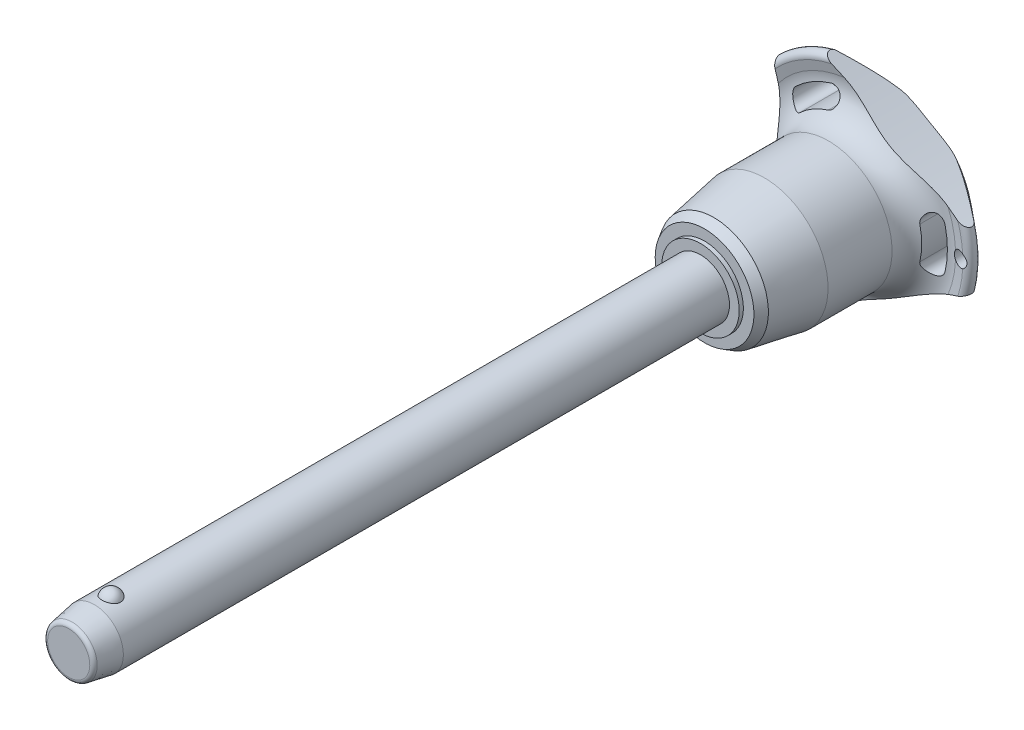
from build123d import *

# Parameters (mm, degrees)
SKETCH1_R           = 6
BOSS_EXTRUDE1_DEPTH = 120
SKETCH2_R           = 5.15
BOSS_EXTRUDE2_DEPTH = 39.7
BOSS_EXTRUDE3_START = 10.6
SKETCH1_2_R         = 6
BOSS_EXTRUDE3_DEPTH = 10.6
CHAMFER1_SIZE       = 5.3
CHAMFER1_SIZE2      = 0.934532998
FILLET1_R           = 0.85
SKETCH6_R           = 144.275
CUT_EXTRUDE1_DEPTH  = 164.211281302
CIRPATTERN1_COUNT   = 3
SKETCH7_R           = 1.5
CUT_EXTRUDE2_DEPTH  = 164.088271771


with BuildPart() as part:
    # Sketch1 → Boss-Extrude1 (new body)
    with BuildSketch(Plane.XY):
        Circle(SKETCH1_R)
    extrude(amount=-BOSS_EXTRUDE1_DEPTH)

    # Sketch2 → Boss-Extrude2 (add)
    with BuildSketch(Plane(origin=(0, 0, -120), x_dir=(-1, 0, 0), z_dir=(0, 0, -1))):
        Circle(SKETCH2_R)
    extrude(amount=BOSS_EXTRUDE2_DEPTH)

    # Sketch3 → Revolve1 (revolve)
    with BuildSketch(Plane(origin=(0, 0, 0), x_dir=(0, 0, -1), z_dir=(1, 0, 0))):
        with BuildLine():
            Line((-1.854049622, 7.25), (-1.854049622, 3.25))
            ThreePointArc((-1.854049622, 3.25), (0.145950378, 5.25), (-1.854049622, 7.25))
        make_face()
        with BuildLine():
            Line((-1.854049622, -3.25), (-1.854049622, -7.25))
            ThreePointArc((-1.854049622, -7.25), (0.145950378, -5.25), (-1.854049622, -3.25))
        make_face()
    revolve(axis=Axis((0, -3.25, 1.854049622), (0, 1, 0)))

    # Sketch1_2 → Boss-Extrude3 (add)
    with BuildSketch(Plane.XY.offset(BOSS_EXTRUDE3_START)):
        Circle(SKETCH1_2_R)
    extrude(amount=-BOSS_EXTRUDE3_DEPTH)

    # Chamfer1
    chamfer1_edges = [part.edges().sort_by_distance(p)[0] for p in [
        (-6, 0, 10.6),
    ]]
    chamfer1_side = [part.faces().sort_by_distance(p)[0] for p in [
        (-6, 0, -54.7),
    ]]
    chamfer(chamfer1_edges, length=CHAMFER1_SIZE, length2=CHAMFER1_SIZE2, reference=chamfer1_side[0])

    # Fillet1
    fillet1_edges = [part.edges().sort_by_distance(p)[0] for p in [
        (-5.065467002, 0, 10.6),
        (5.15, 0, -159.7),
    ]]
    fillet(fillet1_edges, radius=FILLET1_R)

    # Sketch4 → Revolve2 (revolve)
    with BuildSketch(Plane(origin=(0, 0, 0), x_dir=(0, 0, -1), z_dir=(1, 0, 0)), mode=Mode.PRIVATE) as revolve2_sk:
        Polygon((120, 0), (120, 8.017240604), (120.85, 8.017240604), (120.85, 10.206249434), (122.745737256, 11.300753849), (133.233333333, 13.15), (146.466666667, 13.15), (146.466666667, 0), align=None)
    revolve(revolve2_sk.sketch.rotate(Axis((0, 0, -146.466666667), (0, 0, 1)), 90), axis=Axis((0, 0, -146.466666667), (0, 0, 1)))

    # Sketch5 → Revolve3 (revolve)
    with BuildSketch(Plane(origin=(0, 0, 0), x_dir=(0, 0, -1), z_dir=(1, 0, 0)), mode=Mode.PRIVATE) as revolve3_sk:
        with BuildLine():
            Line((152.32877039, 20.428960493), (151.910912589, 22.344207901))
            ThreePointArc((151.910912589, 22.344207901), (152.554394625, 23.677136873), (154.002586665, 23.371345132))
            Line((154.002586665, 23.371345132), (159.141488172, 17.247040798))
            ThreePointArc((159.141488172, 17.247040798), (159.7, 15.584758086), (158.978803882, 13.986322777))
            ThreePointArc((158.978803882, 13.986322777), (154.617427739, 7.589034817), (153.083333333, 0))
            Line((153.083333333, 0), (146.466666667, 0))
            Line((146.466666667, 0), (146.466666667, 13.15))
            ThreePointArc((146.466666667, 13.15), (151.139661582, 15.38660811), (152.32877039, 20.428960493))
        make_face()
    revolve(revolve3_sk.sketch.rotate(Axis((0, 0, -153.083333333), (0, 0, 1)), 90), axis=Axis((0, 0, -153.083333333), (0, 0, 1)))

    # Sketch6 → Cut-Extrude1 (cut, through all)
    with BuildSketch(Plane.XY):
        with Locations((-159.975, 0)):
            Circle(SKETCH6_R)
        with BuildLine():
            ThreePointArc((18.131206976, -4.190753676), (18.60922037, 0), (18.131206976, 4.190753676))
            ThreePointArc((18.131206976, 4.190753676), (15.94840906, 5.553949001), (14.585213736, 3.371151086))
            ThreePointArc((14.585213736, 3.371151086), (14.969740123, 0), (14.585213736, -3.371151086))
            ThreePointArc((14.585213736, -3.371151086), (15.94840906, -5.553949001), (18.131206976, -4.190753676))
        make_face()
    cut_extrude1 = extrude(amount=-CUT_EXTRUDE1_DEPTH, mode=Mode.SUBTRACT)

    # CirPattern1: Cut-Extrude1 ×3 about axis
    cirpattern1_axis = Axis((0, 0, 0), (0, 0, 1))
    for i in range(1, CIRPATTERN1_COUNT):
        add(cut_extrude1.rotate(cirpattern1_axis, i * 360 / CIRPATTERN1_COUNT), mode=Mode.SUBTRACT)

    # Sketch7 → Cut-Extrude2 (cut, through all)
    with BuildSketch(Plane.XY):
        with Locations(Location((21.60922037, 0, 0), (0, 0, 297.620773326))):
            Circle(SKETCH7_R)
    extrude(amount=-CUT_EXTRUDE2_DEPTH, mode=Mode.SUBTRACT)


solid = part.part
